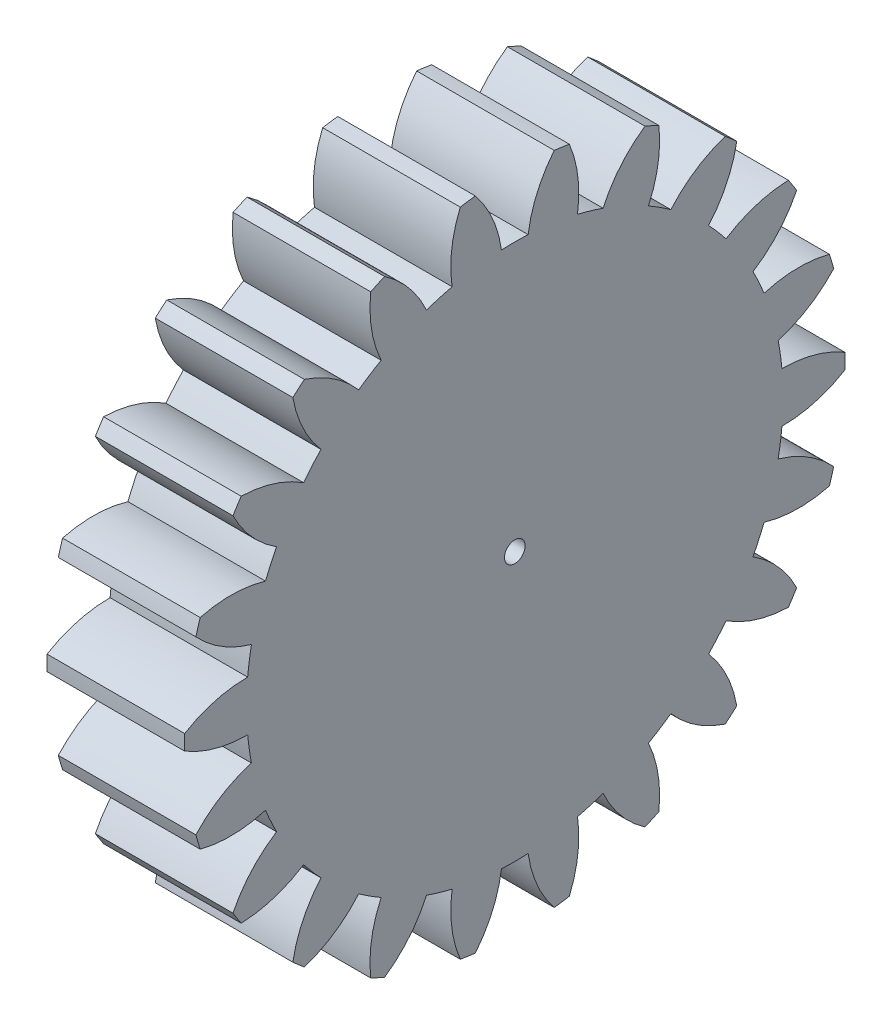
from build123d import *

# Parameters (mm, degrees)
BASPROSKE_W     = 10
BASPROSKE_H     = 24
TOOTHCUT_DEPTH  = 36.383612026
TEETHCUTS_COUNT = 22
TEETHCUTS_ANGLE = 343.636363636
BORSKE_R        = 0.75
BORE_DEPTH      = 50.0000508


with BuildPart() as part:
    # BasProSke → Base-Revolve (revolve)
    with BuildSketch(Plane(origin=(0, 0, 0), x_dir=(1, 0, 0), z_dir=(0, 1, 0)), mode=Mode.PRIVATE) as base_revolve_sk:
        with Locations((5, 12)):
            Rectangle(BASPROSKE_W, BASPROSKE_H)
    revolve(base_revolve_sk.sketch.rotate(Axis((-10, 0, 0), (1, 0, 0)), 180), axis=Axis((-10, 0, 0), (1, 0, 0)))

    # TooCutSke → ToothCut (cut, through all)
    with BuildSketch(Plane(origin=(0, 0, 0), x_dir=(0, 0, -1), z_dir=(1, 0, 0))):
        with BuildLine():
            ThreePointArc((0.968170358, 19.474949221), (0, 19.499), (-0.968170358, 19.474949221))
            ThreePointArc((-0.968170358, 19.474949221), (-1.624144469, 21.795843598), (-2.885568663, 23.851485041))
            ThreePointArc((-2.885568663, 23.851485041), (0, 24.0254), (2.885568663, 23.851485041))
            ThreePointArc((2.885568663, 23.851485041), (1.624144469, 21.795843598), (0.968170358, 19.474949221))
        make_face()
    toothcut = extrude(amount=TOOTHCUT_DEPTH, mode=Mode.SUBTRACT)

    # TeethCuts: ToothCut ×22 about axis
    teethcuts_axis = Axis((-10, 0, 0), (1, 0, 0))
    for i in range(1, TEETHCUTS_COUNT):
        add(toothcut.rotate(teethcuts_axis, i * TEETHCUTS_ANGLE / (TEETHCUTS_COUNT - 1)), mode=Mode.SUBTRACT)

    # BorSke → Bore (cut, symmetric)
    with BuildSketch(Plane(origin=(0, 0, 0), x_dir=(0, 0, -1), z_dir=(1, 0, 0))):
        with Locations(Location((0, 0, 0), (0, 0, 180))):
            Circle(BORSKE_R)
    extrude(amount=BORE_DEPTH, both=True, mode=Mode.SUBTRACT)


solid = part.part
